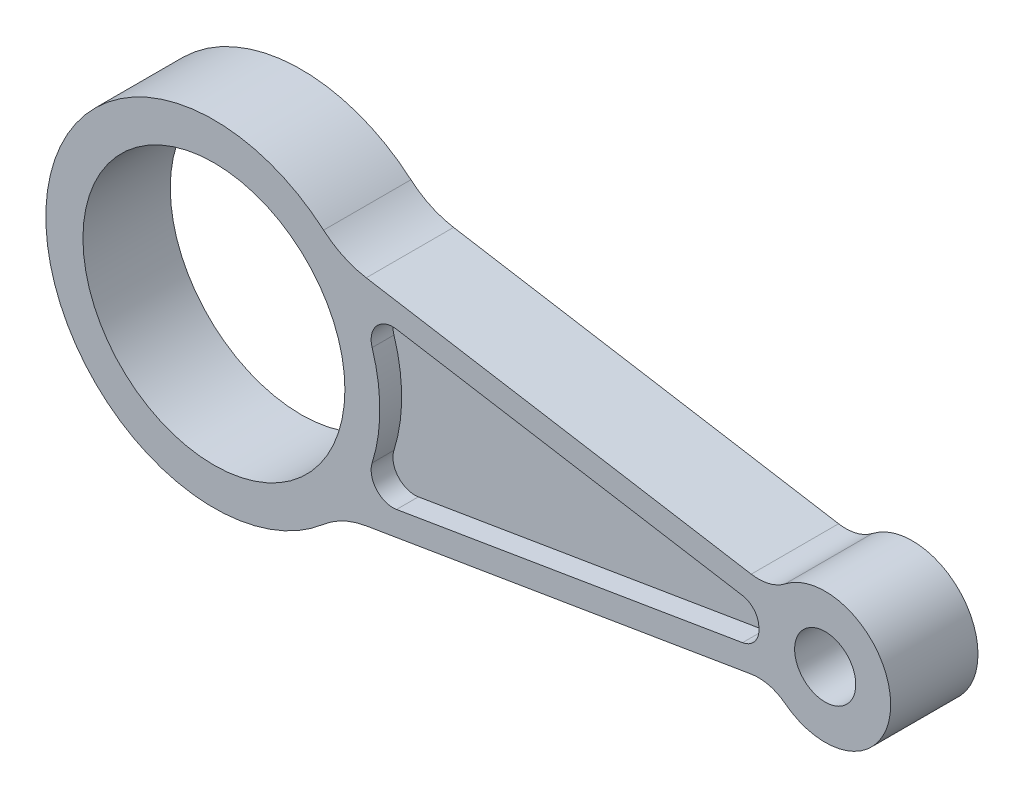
ISO-10303-21;
HEADER;
FILE_DESCRIPTION(('STEP AP214'),'2;1');
FILE_NAME('part.step','',(''),(''),'','','');
FILE_SCHEMA(('AUTOMOTIVE_DESIGN { 1 0 10303 214 1 1 1 1 }'));
ENDSEC;
DATA;
#1=APPLICATION_CONTEXT('core data for automotive mechanical design processes');
#2=APPLICATION_PROTOCOL_DEFINITION('international standard','automotive_design',2000,#1);
#3=PRODUCT_CONTEXT('',#1,'mechanical');
#4=PRODUCT('Part','Part','',(#3));
#5=PRODUCT_RELATED_PRODUCT_CATEGORY('part','',(#4));
#6=PRODUCT_DEFINITION_FORMATION('','',#4);
#7=PRODUCT_DEFINITION_CONTEXT('part definition',#1,'design');
#8=PRODUCT_DEFINITION('design','',#6,#7);
#9=PRODUCT_DEFINITION_SHAPE('','',#8);
#10=(LENGTH_UNIT() NAMED_UNIT(*) SI_UNIT(.MILLI.,.METRE.));
#11=(NAMED_UNIT(*) PLANE_ANGLE_UNIT() SI_UNIT($,.RADIAN.));
#12=(NAMED_UNIT(*) SI_UNIT($,.STERADIAN.) SOLID_ANGLE_UNIT());
#13=UNCERTAINTY_MEASURE_WITH_UNIT(LENGTH_MEASURE(1.E-05),#10,'distance_accuracy_value','');
#14=(GEOMETRIC_REPRESENTATION_CONTEXT(3) GLOBAL_UNCERTAINTY_ASSIGNED_CONTEXT((#13)) GLOBAL_UNIT_ASSIGNED_CONTEXT((#10,
#11,#12)) REPRESENTATION_CONTEXT('',''));
#15=CARTESIAN_POINT('',(0.,0.,0.));
#16=DIRECTION('',(0.,0.,1.));
#17=DIRECTION('',(1.,0.,0.));
#18=AXIS2_PLACEMENT_3D('',#15,#16,#17);
#19=CARTESIAN_POINT('',(0.,0.,-20.));
#20=DIRECTION('',(0.,0.,1.));
#21=DIRECTION('',(1.,0.,0.));
#22=AXIS2_PLACEMENT_3D('',#19,#20,#21);
#23=CYLINDRICAL_SURFACE('',#22,38.5);
#24=CARTESIAN_POINT('',(0.,0.,0.));
#25=DIRECTION('',(0.,0.,1.));
#26=DIRECTION('',(1.,0.,0.));
#27=AXIS2_PLACEMENT_3D('',#24,#25,#26);
#28=CIRCLE('',#27,38.5);
#29=CARTESIAN_POINT('',(25.1205794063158,29.1754432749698,0.));
#30=VERTEX_POINT('',#29);
#31=CARTESIAN_POINT('',(25.1205794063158,-29.1754432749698,0.));
#32=VERTEX_POINT('',#31);
#33=EDGE_CURVE('E309',#30,#32,#28,.T.);
#34=ORIENTED_EDGE('',*,*,#33,.F.);
#35=DIRECTION('',(0.,0.,1.));
#36=VECTOR('',#35,1.);
#37=CARTESIAN_POINT('',(25.1205794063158,29.1754432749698,-20.));
#38=LINE('',#37,#36);
#39=CARTESIAN_POINT('',(25.1205794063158,29.1754432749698,-20.));
#40=VERTEX_POINT('',#39);
#41=EDGE_CURVE('E358',#30,#40,#38,.F.);
#42=ORIENTED_EDGE('',*,*,#41,.T.);
#43=CARTESIAN_POINT('',(0.,0.,-20.));
#44=DIRECTION('',(0.,0.,1.));
#45=DIRECTION('',(1.,0.,0.));
#46=AXIS2_PLACEMENT_3D('',#43,#44,#45);
#47=CIRCLE('',#46,38.5);
#48=CARTESIAN_POINT('',(25.1205794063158,-29.1754432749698,-20.));
#49=VERTEX_POINT('',#48);
#50=EDGE_CURVE('E312',#40,#49,#47,.T.);
#51=ORIENTED_EDGE('',*,*,#50,.T.);
#52=DIRECTION('',(0.,0.,1.));
#53=VECTOR('',#52,1.);
#54=CARTESIAN_POINT('',(25.1205794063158,-29.1754432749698,-20.));
#55=LINE('',#54,#53);
#56=EDGE_CURVE('E355',#49,#32,#55,.T.);
#57=ORIENTED_EDGE('',*,*,#56,.T.);
#58=EDGE_LOOP('',(#34,#42,#51,#57));
#59=FACE_BOUND('',#58,.T.);
#60=ADVANCED_FACE('F35',(#59),#23,.T.);
#61=CARTESIAN_POINT('',(28.7305711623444,25.6281930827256,-20.));
#62=DIRECTION('',(0.164285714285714,0.986412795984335,0.));
#63=DIRECTION('',(-0.986412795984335,0.164285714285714,0.));
#64=AXIS2_PLACEMENT_3D('',#61,#62,#63);
#65=PLANE('',#64);
#66=DIRECTION('',(-0.986412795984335,0.164285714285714,0.));
#67=VECTOR('',#66,1.);
#68=CARTESIAN_POINT('',(28.7305711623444,25.6281930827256,-20.));
#69=LINE('',#68,#67);
#70=CARTESIAN_POINT('',(123.068754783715,9.91629645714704,-20.));
#71=VERTEX_POINT('',#70);
#72=CARTESIAN_POINT('',(34.8845167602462,24.6032617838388,-20.));
#73=VERTEX_POINT('',#72);
#74=EDGE_CURVE('E321',#71,#73,#69,.T.);
#75=ORIENTED_EDGE('',*,*,#74,.T.);
#76=DIRECTION('',(0.,0.,-1.));
#77=VECTOR('',#76,1.);
#78=CARTESIAN_POINT('',(34.8845167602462,24.6032617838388,0.));
#79=LINE('',#78,#77);
#80=CARTESIAN_POINT('',(34.8845167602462,24.6032617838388,0.));
#81=VERTEX_POINT('',#80);
#82=EDGE_CURVE('E352',#73,#81,#79,.F.);
#83=ORIENTED_EDGE('',*,*,#82,.T.);
#84=DIRECTION('',(-0.986412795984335,0.164285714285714,0.));
#85=VECTOR('',#84,1.);
#86=CARTESIAN_POINT('',(28.7305711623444,25.6281930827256,0.));
#87=LINE('',#86,#85);
#88=CARTESIAN_POINT('',(123.068754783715,9.91629645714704,0.));
#89=VERTEX_POINT('',#88);
#90=EDGE_CURVE('E316',#89,#81,#87,.T.);
#91=ORIENTED_EDGE('',*,*,#90,.F.);
#92=DIRECTION('',(0.,0.,-1.));
#93=VECTOR('',#92,1.);
#94=CARTESIAN_POINT('',(123.068754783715,9.91629645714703,-20.));
#95=LINE('',#94,#93);
#96=EDGE_CURVE('E338',#89,#71,#95,.T.);
#97=ORIENTED_EDGE('',*,*,#96,.T.);
#98=EDGE_LOOP('',(#75,#83,#91,#97));
#99=FACE_BOUND('',#98,.T.);
#100=ADVANCED_FACE('F390',(#99),#65,.T.);
#101=CARTESIAN_POINT('',(140.,0.,-20.));
#102=DIRECTION('',(0.,0.,1.));
#103=DIRECTION('',(1.,0.,0.));
#104=AXIS2_PLACEMENT_3D('',#101,#102,#103);
#105=CYLINDRICAL_SURFACE('',#104,15.);
#106=CARTESIAN_POINT('',(140.,0.,-20.));
#107=DIRECTION('',(0.,0.,1.));
#108=DIRECTION('',(1.,0.,0.));
#109=AXIS2_PLACEMENT_3D('',#106,#107,#108);
#110=CIRCLE('',#109,15.);
#111=CARTESIAN_POINT('',(130.826967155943,-11.8682546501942,-20.));
#112=VERTEX_POINT('',#111);
#113=CARTESIAN_POINT('',(130.826967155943,11.8682546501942,-20.));
#114=VERTEX_POINT('',#113);
#115=EDGE_CURVE('E318',#112,#114,#110,.T.);
#116=ORIENTED_EDGE('',*,*,#115,.T.);
#117=DIRECTION('',(0.,0.,1.));
#118=VECTOR('',#117,1.);
#119=CARTESIAN_POINT('',(130.826967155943,11.8682546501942,-20.));
#120=LINE('',#119,#118);
#121=CARTESIAN_POINT('',(130.826967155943,11.8682546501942,0.));
#122=VERTEX_POINT('',#121);
#123=EDGE_CURVE('E335',#114,#122,#120,.T.);
#124=ORIENTED_EDGE('',*,*,#123,.T.);
#125=CARTESIAN_POINT('',(140.,0.,0.));
#126=DIRECTION('',(0.,0.,1.));
#127=DIRECTION('',(1.,0.,0.));
#128=AXIS2_PLACEMENT_3D('',#125,#126,#127);
#129=CIRCLE('',#128,15.);
#130=CARTESIAN_POINT('',(130.826967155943,-11.8682546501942,0.));
#131=VERTEX_POINT('',#130);
#132=EDGE_CURVE('E329',#131,#122,#129,.T.);
#133=ORIENTED_EDGE('',*,*,#132,.F.);
#134=DIRECTION('',(0.,0.,1.));
#135=VECTOR('',#134,1.);
#136=CARTESIAN_POINT('',(130.826967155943,-11.8682546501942,-20.));
#137=LINE('',#136,#135);
#138=EDGE_CURVE('E324',#131,#112,#137,.F.);
#139=ORIENTED_EDGE('',*,*,#138,.T.);
#140=EDGE_LOOP('',(#116,#124,#133,#139));
#141=FACE_BOUND('',#140,.T.);
#142=ADVANCED_FACE('F399',(#141),#105,.T.);
#143=CARTESIAN_POINT('',(28.7305711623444,-25.6281930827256,-20.));
#144=DIRECTION('',(0.164285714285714,-0.986412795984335,0.));
#145=DIRECTION('',(0.986412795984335,0.164285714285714,0.));
#146=AXIS2_PLACEMENT_3D('',#143,#144,#145);
#147=PLANE('',#146);
#148=DIRECTION('',(0.986412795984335,0.164285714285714,0.));
#149=VECTOR('',#148,1.);
#150=CARTESIAN_POINT('',(28.7305711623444,-25.6281930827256,0.));
#151=LINE('',#150,#149);
#152=CARTESIAN_POINT('',(34.8845167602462,-24.6032617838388,0.));
#153=VERTEX_POINT('',#152);
#154=CARTESIAN_POINT('',(123.068754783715,-9.91629645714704,0.));
#155=VERTEX_POINT('',#154);
#156=EDGE_CURVE('E327',#153,#155,#151,.T.);
#157=ORIENTED_EDGE('',*,*,#156,.F.);
#158=DIRECTION('',(0.,0.,-1.));
#159=VECTOR('',#158,1.);
#160=CARTESIAN_POINT('',(34.8845167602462,-24.6032617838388,-20.));
#161=LINE('',#160,#159);
#162=CARTESIAN_POINT('',(34.8845167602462,-24.6032617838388,-20.));
#163=VERTEX_POINT('',#162);
#164=EDGE_CURVE('E360',#153,#163,#161,.T.);
#165=ORIENTED_EDGE('',*,*,#164,.T.);
#166=DIRECTION('',(0.986412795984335,0.164285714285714,0.));
#167=VECTOR('',#166,1.);
#168=CARTESIAN_POINT('',(28.7305711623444,-25.6281930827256,-20.));
#169=LINE('',#168,#167);
#170=CARTESIAN_POINT('',(123.068754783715,-9.91629645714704,-20.));
#171=VERTEX_POINT('',#170);
#172=EDGE_CURVE('E315',#163,#171,#169,.T.);
#173=ORIENTED_EDGE('',*,*,#172,.T.);
#174=DIRECTION('',(0.,0.,-1.));
#175=VECTOR('',#174,1.);
#176=CARTESIAN_POINT('',(123.068754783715,-9.91629645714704,0.));
#177=LINE('',#176,#175);
#178=EDGE_CURVE('E340',#171,#155,#177,.F.);
#179=ORIENTED_EDGE('',*,*,#178,.T.);
#180=EDGE_LOOP('',(#157,#165,#173,#179));
#181=FACE_BOUND('',#180,.T.);
#182=ADVANCED_FACE('F374',(#181),#147,.T.);
#183=CARTESIAN_POINT('',(0.,0.,-20.));
#184=DIRECTION('',(0.,0.,1.));
#185=DIRECTION('',(1.,0.,0.));
#186=AXIS2_PLACEMENT_3D('',#183,#184,#185);
#187=PLANE('',#186);
#188=DIRECTION('',(0.986412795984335,-0.164285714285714,0.));
#189=VECTOR('',#188,1.);
#190=CARTESIAN_POINT('',(121.445609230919,4.61087017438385,-20.));
#191=LINE('',#190,#189);
#192=CARTESIAN_POINT('',(41.8285545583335,17.8709827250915,-20.));
#193=VERTEX_POINT('',#192);
#194=CARTESIAN_POINT('',(121.445609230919,4.61087017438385,-20.));
#195=VERTEX_POINT('',#194);
#196=EDGE_CURVE('E221',#193,#195,#191,.T.);
#197=ORIENTED_EDGE('',*,*,#196,.F.);
#198=CARTESIAN_POINT('',(41.0071259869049,12.9389187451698,-20.));
#199=DIRECTION('',(0.,0.,-1.));
#200=DIRECTION('',(1.,0.,0.));
#201=AXIS2_PLACEMENT_3D('',#198,#199,#200);
#202=CIRCLE('',#201,5.);
#203=CARTESIAN_POINT('',(36.2388555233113,11.4343933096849,-20.));
#204=VERTEX_POINT('',#203);
#205=EDGE_CURVE('E50',#204,#193,#202,.T.);
#206=ORIENTED_EDGE('',*,*,#205,.F.);
#207=CARTESIAN_POINT('',(0.,0.,-20.));
#208=DIRECTION('',(0.,0.,1.));
#209=DIRECTION('',(-1.,0.,0.));
#210=AXIS2_PLACEMENT_3D('',#207,#208,#209);
#211=CIRCLE('',#210,38.);
#212=CARTESIAN_POINT('',(36.2388555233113,-11.4343933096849,-20.));
#213=VERTEX_POINT('',#212);
#214=EDGE_CURVE('E204',#213,#204,#211,.T.);
#215=ORIENTED_EDGE('',*,*,#214,.F.);
#216=CARTESIAN_POINT('',(41.0071259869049,-12.9389187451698,-20.));
#217=DIRECTION('',(0.,0.,-1.));
#218=DIRECTION('',(-1.,0.,0.));
#219=AXIS2_PLACEMENT_3D('',#216,#217,#218);
#220=CIRCLE('',#219,5.);
#221=CARTESIAN_POINT('',(41.8285545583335,-17.8709827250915,-20.));
#222=VERTEX_POINT('',#221);
#223=EDGE_CURVE('E207',#222,#213,#220,.T.);
#224=ORIENTED_EDGE('',*,*,#223,.F.);
#225=DIRECTION('',(-0.986412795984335,-0.164285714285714,0.));
#226=VECTOR('',#225,1.);
#227=CARTESIAN_POINT('',(121.433526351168,-4.61288256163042,-20.));
#228=LINE('',#227,#226);
#229=CARTESIAN_POINT('',(121.433526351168,-4.61288256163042,-20.));
#230=VERTEX_POINT('',#229);
#231=EDGE_CURVE('E229',#230,#222,#228,.T.);
#232=ORIENTED_EDGE('',*,*,#231,.F.);
#233=CARTESIAN_POINT('',(120.694240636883,-0.174024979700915,-20.));
#234=DIRECTION('',(0.,0.,-1.));
#235=DIRECTION('',(-1.,0.,0.));
#236=AXIS2_PLACEMENT_3D('',#233,#234,#235);
#237=CIRCLE('',#236,4.5);
#238=CARTESIAN_POINT('',(125.194211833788,-0.157924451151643,-20.));
#239=VERTEX_POINT('',#238);
#240=EDGE_CURVE('E226',#239,#230,#237,.T.);
#241=ORIENTED_EDGE('',*,*,#240,.F.);
#242=CARTESIAN_POINT('',(120.706323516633,0.172012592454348,-20.));
#243=DIRECTION('',(0.,0.,-1.));
#244=DIRECTION('',(1.,0.,0.));
#245=AXIS2_PLACEMENT_3D('',#242,#243,#244);
#246=CIRCLE('',#245,4.5);
#247=EDGE_CURVE('E223',#195,#239,#246,.T.);
#248=ORIENTED_EDGE('',*,*,#247,.F.);
#249=EDGE_LOOP('',(#197,#206,#215,#224,#232,#241,#248));
#250=FACE_BOUND('',#249,.T.);
#251=CARTESIAN_POINT('',(140.,0.,-20.));
#252=DIRECTION('',(0.,0.,1.));
#253=DIRECTION('',(1.,0.,0.));
#254=AXIS2_PLACEMENT_3D('',#251,#252,#253);
#255=CIRCLE('',#254,7.00000000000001);
#256=CARTESIAN_POINT('',(147.,0.,-20.));
#257=VERTEX_POINT('',#256);
#258=EDGE_CURVE('E300',#257,#257,#255,.T.);
#259=ORIENTED_EDGE('',*,*,#258,.T.);
#260=EDGE_LOOP('',(#259));
#261=FACE_BOUND('',#260,.T.);
#262=CARTESIAN_POINT('',(0.,0.,-20.));
#263=DIRECTION('',(0.,0.,1.));
#264=DIRECTION('',(1.,0.,0.));
#265=AXIS2_PLACEMENT_3D('',#262,#263,#264);
#266=CIRCLE('',#265,30.);
#267=CARTESIAN_POINT('',(30.,0.,-20.));
#268=VERTEX_POINT('',#267);
#269=EDGE_CURVE('E306',#268,#268,#266,.T.);
#270=ORIENTED_EDGE('',*,*,#269,.T.);
#271=EDGE_LOOP('',(#270));
#272=FACE_BOUND('',#271,.T.);
#273=ORIENTED_EDGE('',*,*,#50,.F.);
#274=CARTESIAN_POINT('',(38.1702310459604,44.3315177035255,-20.));
#275=DIRECTION('',(0.,0.,1.));
#276=DIRECTION('',(1.,0.,0.));
#277=AXIS2_PLACEMENT_3D('',#274,#275,#276);
#278=CIRCLE('',#277,20.);
#279=EDGE_CURVE('E364',#40,#73,#278,.T.);
#280=ORIENTED_EDGE('',*,*,#279,.T.);
#281=ORIENTED_EDGE('',*,*,#74,.F.);
#282=CARTESIAN_POINT('',(124.711611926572,19.7804244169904,-20.));
#283=DIRECTION('',(0.,0.,1.));
#284=DIRECTION('',(1.,0.,0.));
#285=AXIS2_PLACEMENT_3D('',#282,#283,#284);
#286=CIRCLE('',#285,10.);
#287=EDGE_CURVE('E345',#71,#114,#286,.T.);
#288=ORIENTED_EDGE('',*,*,#287,.T.);
#289=ORIENTED_EDGE('',*,*,#115,.F.);
#290=CARTESIAN_POINT('',(124.711611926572,-19.7804244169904,-20.));
#291=DIRECTION('',(0.,0.,1.));
#292=DIRECTION('',(1.,0.,0.));
#293=AXIS2_PLACEMENT_3D('',#290,#291,#292);
#294=CIRCLE('',#293,10.);
#295=EDGE_CURVE('E349',#112,#171,#294,.T.);
#296=ORIENTED_EDGE('',*,*,#295,.T.);
#297=ORIENTED_EDGE('',*,*,#172,.F.);
#298=CARTESIAN_POINT('',(38.1702310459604,-44.3315177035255,-20.));
#299=DIRECTION('',(0.,0.,1.));
#300=DIRECTION('',(1.,0.,0.));
#301=AXIS2_PLACEMENT_3D('',#298,#299,#300);
#302=CIRCLE('',#301,20.);
#303=EDGE_CURVE('E11',#163,#49,#302,.T.);
#304=ORIENTED_EDGE('',*,*,#303,.T.);
#305=EDGE_LOOP('',(#273,#280,#281,#288,#289,#296,#297,#304));
#306=FACE_BOUND('',#305,.T.);
#307=ADVANCED_FACE('F380',(#250,#261,#272,#306),#187,.F.);
#308=CARTESIAN_POINT('',(0.,0.,0.));
#309=DIRECTION('',(0.,0.,1.));
#310=DIRECTION('',(1.,0.,0.));
#311=AXIS2_PLACEMENT_3D('',#308,#309,#310);
#312=PLANE('',#311);
#313=CARTESIAN_POINT('',(41.0071259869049,12.9389187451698,0.));
#314=DIRECTION('',(0.,0.,1.));
#315=DIRECTION('',(-1.,0.,0.));
#316=AXIS2_PLACEMENT_3D('',#313,#314,#315);
#317=CIRCLE('',#316,5.);
#318=CARTESIAN_POINT('',(41.8285545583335,17.8709827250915,0.));
#319=VERTEX_POINT('',#318);
#320=CARTESIAN_POINT('',(36.2388555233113,11.4343933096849,0.));
#321=VERTEX_POINT('',#320);
#322=EDGE_CURVE('E58',#319,#321,#317,.T.);
#323=ORIENTED_EDGE('',*,*,#322,.F.);
#324=DIRECTION('',(-0.986412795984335,0.164285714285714,0.));
#325=VECTOR('',#324,1.);
#326=CARTESIAN_POINT('',(41.8285545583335,17.8709827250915,0.));
#327=LINE('',#326,#325);
#328=CARTESIAN_POINT('',(121.046940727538,4.67726787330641,0.));
#329=VERTEX_POINT('',#328);
#330=EDGE_CURVE('E249',#329,#319,#327,.T.);
#331=ORIENTED_EDGE('',*,*,#330,.F.);
#332=CARTESIAN_POINT('',(120.307655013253,0.238410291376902,0.));
#333=DIRECTION('',(0.,0.,1.));
#334=DIRECTION('',(1.,0.,0.));
#335=AXIS2_PLACEMENT_3D('',#332,#333,#334);
#336=CIRCLE('',#335,4.5);
#337=CARTESIAN_POINT('',(124.807655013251,0.238406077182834,0.));
#338=VERTEX_POINT('',#337);
#339=EDGE_CURVE('E281',#338,#329,#336,.T.);
#340=ORIENTED_EDGE('',*,*,#339,.F.);
#341=CARTESIAN_POINT('',(120.332548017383,-0.234264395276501,0.));
#342=DIRECTION('',(0.,0.,1.));
#343=DIRECTION('',(-1.,0.,0.));
#344=AXIS2_PLACEMENT_3D('',#341,#342,#343);
#345=CIRCLE('',#344,4.5);
#346=CARTESIAN_POINT('',(121.071833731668,-4.67312197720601,0.));
#347=VERTEX_POINT('',#346);
#348=EDGE_CURVE('E278',#347,#338,#345,.T.);
#349=ORIENTED_EDGE('',*,*,#348,.F.);
#350=DIRECTION('',(0.986412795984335,0.164285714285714,0.));
#351=VECTOR('',#350,1.);
#352=CARTESIAN_POINT('',(41.8285545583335,-17.8709827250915,0.));
#353=LINE('',#352,#351);
#354=CARTESIAN_POINT('',(41.8285545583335,-17.8709827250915,0.));
#355=VERTEX_POINT('',#354);
#356=EDGE_CURVE('E275',#355,#347,#353,.T.);
#357=ORIENTED_EDGE('',*,*,#356,.F.);
#358=CARTESIAN_POINT('',(41.0071259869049,-12.9389187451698,0.));
#359=DIRECTION('',(0.,0.,1.));
#360=DIRECTION('',(-1.,0.,0.));
#361=AXIS2_PLACEMENT_3D('',#358,#359,#360);
#362=CIRCLE('',#361,5.);
#363=CARTESIAN_POINT('',(36.2388555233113,-11.4343933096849,0.));
#364=VERTEX_POINT('',#363);
#365=EDGE_CURVE('E272',#364,#355,#362,.T.);
#366=ORIENTED_EDGE('',*,*,#365,.F.);
#367=CARTESIAN_POINT('',(0.,0.,0.));
#368=DIRECTION('',(0.,0.,-1.));
#369=DIRECTION('',(1.,0.,0.));
#370=AXIS2_PLACEMENT_3D('',#367,#368,#369);
#371=CIRCLE('',#370,38.);
#372=EDGE_CURVE('E269',#321,#364,#371,.T.);
#373=ORIENTED_EDGE('',*,*,#372,.F.);
#374=EDGE_LOOP('',(#323,#331,#340,#349,#357,#366,#373));
#375=FACE_BOUND('',#374,.T.);
#376=CARTESIAN_POINT('',(140.,0.,0.));
#377=DIRECTION('',(0.,0.,1.));
#378=DIRECTION('',(1.,0.,0.));
#379=AXIS2_PLACEMENT_3D('',#376,#377,#378);
#380=CIRCLE('',#379,7.00000000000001);
#381=CARTESIAN_POINT('',(147.,0.,0.));
#382=VERTEX_POINT('',#381);
#383=EDGE_CURVE('E288',#382,#382,#380,.T.);
#384=ORIENTED_EDGE('',*,*,#383,.F.);
#385=EDGE_LOOP('',(#384));
#386=FACE_BOUND('',#385,.T.);
#387=CARTESIAN_POINT('',(0.,0.,0.));
#388=DIRECTION('',(0.,0.,1.));
#389=DIRECTION('',(1.,0.,0.));
#390=AXIS2_PLACEMENT_3D('',#387,#388,#389);
#391=CIRCLE('',#390,30.);
#392=CARTESIAN_POINT('',(30.,0.,0.));
#393=VERTEX_POINT('',#392);
#394=EDGE_CURVE('E303',#393,#393,#391,.T.);
#395=ORIENTED_EDGE('',*,*,#394,.F.);
#396=EDGE_LOOP('',(#395));
#397=FACE_BOUND('',#396,.T.);
#398=ORIENTED_EDGE('',*,*,#90,.T.);
#399=CARTESIAN_POINT('',(38.1702310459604,44.3315177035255,0.));
#400=DIRECTION('',(0.,0.,1.));
#401=DIRECTION('',(1.,0.,0.));
#402=AXIS2_PLACEMENT_3D('',#399,#400,#401);
#403=CIRCLE('',#402,20.);
#404=EDGE_CURVE('E362',#81,#30,#403,.F.);
#405=ORIENTED_EDGE('',*,*,#404,.T.);
#406=ORIENTED_EDGE('',*,*,#33,.T.);
#407=CARTESIAN_POINT('',(38.1702310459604,-44.3315177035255,0.));
#408=DIRECTION('',(0.,0.,1.));
#409=DIRECTION('',(1.,0.,0.));
#410=AXIS2_PLACEMENT_3D('',#407,#408,#409);
#411=CIRCLE('',#410,20.);
#412=EDGE_CURVE('E43',#32,#153,#411,.F.);
#413=ORIENTED_EDGE('',*,*,#412,.T.);
#414=ORIENTED_EDGE('',*,*,#156,.T.);
#415=CARTESIAN_POINT('',(124.711611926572,-19.7804244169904,0.));
#416=DIRECTION('',(0.,0.,1.));
#417=DIRECTION('',(1.,0.,0.));
#418=AXIS2_PLACEMENT_3D('',#415,#416,#417);
#419=CIRCLE('',#418,10.);
#420=EDGE_CURVE('E347',#155,#131,#419,.F.);
#421=ORIENTED_EDGE('',*,*,#420,.T.);
#422=ORIENTED_EDGE('',*,*,#132,.T.);
#423=CARTESIAN_POINT('',(124.711611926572,19.7804244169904,0.));
#424=DIRECTION('',(0.,0.,1.));
#425=DIRECTION('',(1.,0.,0.));
#426=AXIS2_PLACEMENT_3D('',#423,#424,#425);
#427=CIRCLE('',#426,10.);
#428=EDGE_CURVE('E343',#122,#89,#427,.F.);
#429=ORIENTED_EDGE('',*,*,#428,.T.);
#430=EDGE_LOOP('',(#398,#405,#406,#413,#414,#421,#422,#429));
#431=FACE_BOUND('',#430,.T.);
#432=ADVANCED_FACE('F367',(#375,#386,#397,#431),#312,.T.);
#433=CARTESIAN_POINT('',(0.,0.,-20.));
#434=DIRECTION('',(0.,0.,1.));
#435=DIRECTION('',(1.,0.,0.));
#436=AXIS2_PLACEMENT_3D('',#433,#434,#435);
#437=CYLINDRICAL_SURFACE('',#436,30.);
#438=ORIENTED_EDGE('',*,*,#269,.F.);
#439=EDGE_LOOP('',(#438));
#440=FACE_BOUND('',#439,.T.);
#441=ORIENTED_EDGE('',*,*,#394,.T.);
#442=EDGE_LOOP('',(#441));
#443=FACE_BOUND('',#442,.T.);
#444=ADVANCED_FACE('F425',(#440,#443),#437,.F.);
#445=CARTESIAN_POINT('',(140.,0.,-20.));
#446=DIRECTION('',(0.,0.,1.));
#447=DIRECTION('',(1.,0.,0.));
#448=AXIS2_PLACEMENT_3D('',#445,#446,#447);
#449=CYLINDRICAL_SURFACE('',#448,7.00000000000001);
#450=ORIENTED_EDGE('',*,*,#258,.F.);
#451=EDGE_LOOP('',(#450));
#452=FACE_BOUND('',#451,.T.);
#453=ORIENTED_EDGE('',*,*,#383,.T.);
#454=EDGE_LOOP('',(#453));
#455=FACE_BOUND('',#454,.T.);
#456=ADVANCED_FACE('F410',(#452,#455),#449,.F.);
#457=CARTESIAN_POINT('',(124.711611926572,19.7804244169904,-20.));
#458=DIRECTION('',(0.,0.,1.));
#459=DIRECTION('',(1.,0.,0.));
#460=AXIS2_PLACEMENT_3D('',#457,#458,#459);
#461=CYLINDRICAL_SURFACE('',#460,10.);
#462=ORIENTED_EDGE('',*,*,#287,.F.);
#463=ORIENTED_EDGE('',*,*,#96,.F.);
#464=ORIENTED_EDGE('',*,*,#428,.F.);
#465=ORIENTED_EDGE('',*,*,#123,.F.);
#466=EDGE_LOOP('',(#462,#463,#464,#465));
#467=FACE_BOUND('',#466,.T.);
#468=ADVANCED_FACE('F394',(#467),#461,.F.);
#469=CARTESIAN_POINT('',(124.711611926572,-19.7804244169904,-20.));
#470=DIRECTION('',(0.,0.,1.));
#471=DIRECTION('',(1.,0.,0.));
#472=AXIS2_PLACEMENT_3D('',#469,#470,#471);
#473=CYLINDRICAL_SURFACE('',#472,10.);
#474=ORIENTED_EDGE('',*,*,#295,.F.);
#475=ORIENTED_EDGE('',*,*,#138,.F.);
#476=ORIENTED_EDGE('',*,*,#420,.F.);
#477=ORIENTED_EDGE('',*,*,#178,.F.);
#478=EDGE_LOOP('',(#474,#475,#476,#477));
#479=FACE_BOUND('',#478,.T.);
#480=ADVANCED_FACE('F403',(#479),#473,.F.);
#481=CARTESIAN_POINT('',(38.1702310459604,44.3315177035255,-20.));
#482=DIRECTION('',(0.,0.,1.));
#483=DIRECTION('',(1.,0.,0.));
#484=AXIS2_PLACEMENT_3D('',#481,#482,#483);
#485=CYLINDRICAL_SURFACE('',#484,20.);
#486=ORIENTED_EDGE('',*,*,#279,.F.);
#487=ORIENTED_EDGE('',*,*,#41,.F.);
#488=ORIENTED_EDGE('',*,*,#404,.F.);
#489=ORIENTED_EDGE('',*,*,#82,.F.);
#490=EDGE_LOOP('',(#486,#487,#488,#489));
#491=FACE_BOUND('',#490,.T.);
#492=ADVANCED_FACE('F385',(#491),#485,.F.);
#493=CARTESIAN_POINT('',(38.1702310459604,-44.3315177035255,-20.));
#494=DIRECTION('',(0.,0.,1.));
#495=DIRECTION('',(1.,0.,0.));
#496=AXIS2_PLACEMENT_3D('',#493,#494,#495);
#497=CYLINDRICAL_SURFACE('',#496,20.);
#498=ORIENTED_EDGE('',*,*,#303,.F.);
#499=ORIENTED_EDGE('',*,*,#164,.F.);
#500=ORIENTED_EDGE('',*,*,#412,.F.);
#501=ORIENTED_EDGE('',*,*,#56,.F.);
#502=EDGE_LOOP('',(#498,#499,#500,#501));
#503=FACE_BOUND('',#502,.T.);
#504=ADVANCED_FACE('F37',(#503),#497,.F.);
#505=CARTESIAN_POINT('',(41.0071259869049,12.9389187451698,-5.));
#506=DIRECTION('',(0.,0.,1.));
#507=DIRECTION('',(1.,0.,0.));
#508=AXIS2_PLACEMENT_3D('',#505,#506,#507);
#509=CYLINDRICAL_SURFACE('',#508,5.);
#510=ORIENTED_EDGE('',*,*,#322,.T.);
#511=DIRECTION('',(0.,0.,1.));
#512=VECTOR('',#511,1.);
#513=CARTESIAN_POINT('',(36.2388555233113,11.4343933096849,-5.));
#514=LINE('',#513,#512);
#515=CARTESIAN_POINT('',(36.2388555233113,11.4343933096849,-5.));
#516=VERTEX_POINT('',#515);
#517=EDGE_CURVE('E267',#516,#321,#514,.T.);
#518=ORIENTED_EDGE('',*,*,#517,.F.);
#519=CARTESIAN_POINT('',(41.0071259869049,12.9389187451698,-5.));
#520=DIRECTION('',(0.,0.,1.));
#521=DIRECTION('',(-1.,0.,0.));
#522=AXIS2_PLACEMENT_3D('',#519,#520,#521);
#523=CIRCLE('',#522,5.);
#524=CARTESIAN_POINT('',(41.8285545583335,17.8709827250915,-5.));
#525=VERTEX_POINT('',#524);
#526=EDGE_CURVE('E245',#525,#516,#523,.T.);
#527=ORIENTED_EDGE('',*,*,#526,.F.);
#528=DIRECTION('',(0.,0.,1.));
#529=VECTOR('',#528,1.);
#530=CARTESIAN_POINT('',(41.8285545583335,17.8709827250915,-5.));
#531=LINE('',#530,#529);
#532=EDGE_CURVE('E286',#525,#319,#531,.T.);
#533=ORIENTED_EDGE('',*,*,#532,.T.);
#534=EDGE_LOOP('',(#510,#518,#527,#533));
#535=FACE_BOUND('',#534,.T.);
#536=ADVANCED_FACE('F436',(#535),#509,.F.);
#537=CARTESIAN_POINT('',(41.8285545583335,17.8709827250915,-5.));
#538=DIRECTION('',(0.164285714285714,0.986412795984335,0.));
#539=DIRECTION('',(-0.986412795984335,0.164285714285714,0.));
#540=AXIS2_PLACEMENT_3D('',#537,#538,#539);
#541=PLANE('',#540);
#542=ORIENTED_EDGE('',*,*,#330,.T.);
#543=ORIENTED_EDGE('',*,*,#532,.F.);
#544=DIRECTION('',(-0.986412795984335,0.164285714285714,0.));
#545=VECTOR('',#544,1.);
#546=CARTESIAN_POINT('',(41.8285545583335,17.8709827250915,-5.));
#547=LINE('',#546,#545);
#548=CARTESIAN_POINT('',(121.046940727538,4.67726787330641,-5.));
#549=VERTEX_POINT('',#548);
#550=EDGE_CURVE('E264',#549,#525,#547,.T.);
#551=ORIENTED_EDGE('',*,*,#550,.F.);
#552=DIRECTION('',(0.,0.,1.));
#553=VECTOR('',#552,1.);
#554=CARTESIAN_POINT('',(121.046940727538,4.67726787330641,-5.));
#555=LINE('',#554,#553);
#556=EDGE_CURVE('E289',#549,#329,#555,.T.);
#557=ORIENTED_EDGE('',*,*,#556,.T.);
#558=EDGE_LOOP('',(#542,#543,#551,#557));
#559=FACE_BOUND('',#558,.T.);
#560=ADVANCED_FACE('F439',(#559),#541,.F.);
#561=CARTESIAN_POINT('',(120.307655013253,0.238410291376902,-5.));
#562=DIRECTION('',(0.,0.,1.));
#563=DIRECTION('',(1.,0.,0.));
#564=AXIS2_PLACEMENT_3D('',#561,#562,#563);
#565=CYLINDRICAL_SURFACE('',#564,4.5);
#566=ORIENTED_EDGE('',*,*,#339,.T.);
#567=ORIENTED_EDGE('',*,*,#556,.F.);
#568=CARTESIAN_POINT('',(120.307655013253,0.238410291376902,-5.));
#569=DIRECTION('',(0.,0.,1.));
#570=DIRECTION('',(1.,0.,0.));
#571=AXIS2_PLACEMENT_3D('',#568,#569,#570);
#572=CIRCLE('',#571,4.5);
#573=CARTESIAN_POINT('',(124.807655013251,0.238406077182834,-5.));
#574=VERTEX_POINT('',#573);
#575=EDGE_CURVE('E261',#574,#549,#572,.T.);
#576=ORIENTED_EDGE('',*,*,#575,.F.);
#577=DIRECTION('',(0.,0.,1.));
#578=VECTOR('',#577,1.);
#579=CARTESIAN_POINT('',(124.807655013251,0.238406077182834,-5.));
#580=LINE('',#579,#578);
#581=EDGE_CURVE('E291',#574,#338,#580,.T.);
#582=ORIENTED_EDGE('',*,*,#581,.T.);
#583=EDGE_LOOP('',(#566,#567,#576,#582));
#584=FACE_BOUND('',#583,.T.);
#585=ADVANCED_FACE('F456',(#584),#565,.F.);
#586=CARTESIAN_POINT('',(120.332548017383,-0.234264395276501,-5.));
#587=DIRECTION('',(0.,0.,1.));
#588=DIRECTION('',(1.,0.,0.));
#589=AXIS2_PLACEMENT_3D('',#586,#587,#588);
#590=CYLINDRICAL_SURFACE('',#589,4.5);
#591=ORIENTED_EDGE('',*,*,#348,.T.);
#592=ORIENTED_EDGE('',*,*,#581,.F.);
#593=CARTESIAN_POINT('',(120.332548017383,-0.234264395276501,-5.));
#594=DIRECTION('',(0.,0.,1.));
#595=DIRECTION('',(-1.,0.,0.));
#596=AXIS2_PLACEMENT_3D('',#593,#594,#595);
#597=CIRCLE('',#596,4.5);
#598=CARTESIAN_POINT('',(121.071833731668,-4.67312197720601,-5.));
#599=VERTEX_POINT('',#598);
#600=EDGE_CURVE('E258',#599,#574,#597,.T.);
#601=ORIENTED_EDGE('',*,*,#600,.F.);
#602=DIRECTION('',(0.,0.,1.));
#603=VECTOR('',#602,1.);
#604=CARTESIAN_POINT('',(121.071833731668,-4.67312197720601,-5.));
#605=LINE('',#604,#603);
#606=EDGE_CURVE('E293',#599,#347,#605,.T.);
#607=ORIENTED_EDGE('',*,*,#606,.T.);
#608=EDGE_LOOP('',(#591,#592,#601,#607));
#609=FACE_BOUND('',#608,.T.);
#610=ADVANCED_FACE('F452',(#609),#590,.F.);
#611=CARTESIAN_POINT('',(41.8285545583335,-17.8709827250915,-5.));
#612=DIRECTION('',(0.164285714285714,-0.986412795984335,0.));
#613=DIRECTION('',(0.986412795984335,0.164285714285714,0.));
#614=AXIS2_PLACEMENT_3D('',#611,#612,#613);
#615=PLANE('',#614);
#616=ORIENTED_EDGE('',*,*,#356,.T.);
#617=ORIENTED_EDGE('',*,*,#606,.F.);
#618=DIRECTION('',(0.986412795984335,0.164285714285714,0.));
#619=VECTOR('',#618,1.);
#620=CARTESIAN_POINT('',(41.8285545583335,-17.8709827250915,-5.));
#621=LINE('',#620,#619);
#622=CARTESIAN_POINT('',(41.8285545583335,-17.8709827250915,-5.));
#623=VERTEX_POINT('',#622);
#624=EDGE_CURVE('E255',#623,#599,#621,.T.);
#625=ORIENTED_EDGE('',*,*,#624,.F.);
#626=DIRECTION('',(0.,0.,1.));
#627=VECTOR('',#626,1.);
#628=CARTESIAN_POINT('',(41.8285545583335,-17.8709827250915,-5.));
#629=LINE('',#628,#627);
#630=EDGE_CURVE('E295',#623,#355,#629,.T.);
#631=ORIENTED_EDGE('',*,*,#630,.T.);
#632=EDGE_LOOP('',(#616,#617,#625,#631));
#633=FACE_BOUND('',#632,.T.);
#634=ADVANCED_FACE('F448',(#633),#615,.F.);
#635=CARTESIAN_POINT('',(41.0071259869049,-12.9389187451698,-5.));
#636=DIRECTION('',(0.,0.,1.));
#637=DIRECTION('',(1.,0.,0.));
#638=AXIS2_PLACEMENT_3D('',#635,#636,#637);
#639=CYLINDRICAL_SURFACE('',#638,5.);
#640=ORIENTED_EDGE('',*,*,#365,.T.);
#641=ORIENTED_EDGE('',*,*,#630,.F.);
#642=CARTESIAN_POINT('',(41.0071259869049,-12.9389187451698,-5.));
#643=DIRECTION('',(0.,0.,1.));
#644=DIRECTION('',(-1.,0.,0.));
#645=AXIS2_PLACEMENT_3D('',#642,#643,#644);
#646=CIRCLE('',#645,5.);
#647=CARTESIAN_POINT('',(36.2388555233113,-11.4343933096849,-5.));
#648=VERTEX_POINT('',#647);
#649=EDGE_CURVE('E252',#648,#623,#646,.T.);
#650=ORIENTED_EDGE('',*,*,#649,.F.);
#651=DIRECTION('',(0.,0.,1.));
#652=VECTOR('',#651,1.);
#653=CARTESIAN_POINT('',(36.2388555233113,-11.4343933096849,-5.));
#654=LINE('',#653,#652);
#655=EDGE_CURVE('E297',#648,#364,#654,.T.);
#656=ORIENTED_EDGE('',*,*,#655,.T.);
#657=EDGE_LOOP('',(#640,#641,#650,#656));
#658=FACE_BOUND('',#657,.T.);
#659=ADVANCED_FACE('F444',(#658),#639,.F.);
#660=CARTESIAN_POINT('',(0.,0.,-5.));
#661=DIRECTION('',(0.,0.,1.));
#662=DIRECTION('',(1.,0.,0.));
#663=AXIS2_PLACEMENT_3D('',#660,#661,#662);
#664=CYLINDRICAL_SURFACE('',#663,38.);
#665=ORIENTED_EDGE('',*,*,#372,.T.);
#666=ORIENTED_EDGE('',*,*,#655,.F.);
#667=CARTESIAN_POINT('',(0.,0.,-5.));
#668=DIRECTION('',(0.,0.,-1.));
#669=DIRECTION('',(1.,0.,0.));
#670=AXIS2_PLACEMENT_3D('',#667,#668,#669);
#671=CIRCLE('',#670,38.);
#672=EDGE_CURVE('E248',#516,#648,#671,.T.);
#673=ORIENTED_EDGE('',*,*,#672,.F.);
#674=ORIENTED_EDGE('',*,*,#517,.T.);
#675=EDGE_LOOP('',(#665,#666,#673,#674));
#676=FACE_BOUND('',#675,.T.);
#677=ADVANCED_FACE('F440',(#676),#664,.T.);
#678=CARTESIAN_POINT('',(41.0071259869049,12.9389187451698,-5.));
#679=DIRECTION('',(0.,0.,-1.));
#680=DIRECTION('',(-1.,0.,0.));
#681=AXIS2_PLACEMENT_3D('',#678,#679,#680);
#682=PLANE('',#681);
#683=ORIENTED_EDGE('',*,*,#526,.T.);
#684=ORIENTED_EDGE('',*,*,#672,.T.);
#685=ORIENTED_EDGE('',*,*,#649,.T.);
#686=ORIENTED_EDGE('',*,*,#624,.T.);
#687=ORIENTED_EDGE('',*,*,#600,.T.);
#688=ORIENTED_EDGE('',*,*,#575,.T.);
#689=ORIENTED_EDGE('',*,*,#550,.T.);
#690=EDGE_LOOP('',(#683,#684,#685,#686,#687,#688,#689));
#691=FACE_BOUND('',#690,.T.);
#692=ADVANCED_FACE('F443',(#691),#682,.F.);
#693=CARTESIAN_POINT('',(41.0071259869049,12.9389187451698,-15.));
#694=DIRECTION('',(0.,0.,-1.));
#695=DIRECTION('',(-1.,0.,0.));
#696=AXIS2_PLACEMENT_3D('',#693,#694,#695);
#697=CYLINDRICAL_SURFACE('',#696,5.);
#698=ORIENTED_EDGE('',*,*,#205,.T.);
#699=DIRECTION('',(0.,0.,-1.));
#700=VECTOR('',#699,1.);
#701=CARTESIAN_POINT('',(41.8285545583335,17.8709827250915,-15.));
#702=LINE('',#701,#700);
#703=CARTESIAN_POINT('',(41.8285545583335,17.8709827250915,-15.));
#704=VERTEX_POINT('',#703);
#705=EDGE_CURVE('E181',#704,#193,#702,.T.);
#706=ORIENTED_EDGE('',*,*,#705,.F.);
#707=CARTESIAN_POINT('',(41.0071259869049,12.9389187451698,-15.));
#708=DIRECTION('',(0.,0.,-1.));
#709=DIRECTION('',(1.,0.,0.));
#710=AXIS2_PLACEMENT_3D('',#707,#708,#709);
#711=CIRCLE('',#710,5.);
#712=CARTESIAN_POINT('',(36.2388555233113,11.4343933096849,-15.));
#713=VERTEX_POINT('',#712);
#714=EDGE_CURVE('E185',#713,#704,#711,.T.);
#715=ORIENTED_EDGE('',*,*,#714,.F.);
#716=DIRECTION('',(0.,0.,-1.));
#717=VECTOR('',#716,1.);
#718=CARTESIAN_POINT('',(36.2388555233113,11.4343933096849,-15.));
#719=LINE('',#718,#717);
#720=EDGE_CURVE('E234',#713,#204,#719,.T.);
#721=ORIENTED_EDGE('',*,*,#720,.T.);
#722=EDGE_LOOP('',(#698,#706,#715,#721));
#723=FACE_BOUND('',#722,.T.);
#724=ADVANCED_FACE('F183',(#723),#697,.F.);
#725=CARTESIAN_POINT('',(0.,0.,-15.));
#726=DIRECTION('',(0.,0.,-1.));
#727=DIRECTION('',(-1.,0.,0.));
#728=AXIS2_PLACEMENT_3D('',#725,#726,#727);
#729=CYLINDRICAL_SURFACE('',#728,38.);
#730=ORIENTED_EDGE('',*,*,#214,.T.);
#731=ORIENTED_EDGE('',*,*,#720,.F.);
#732=CARTESIAN_POINT('',(0.,0.,-15.));
#733=DIRECTION('',(0.,0.,1.));
#734=DIRECTION('',(-1.,0.,0.));
#735=AXIS2_PLACEMENT_3D('',#732,#733,#734);
#736=CIRCLE('',#735,38.);
#737=CARTESIAN_POINT('',(36.2388555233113,-11.4343933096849,-15.));
#738=VERTEX_POINT('',#737);
#739=EDGE_CURVE('E191',#738,#713,#736,.T.);
#740=ORIENTED_EDGE('',*,*,#739,.F.);
#741=DIRECTION('',(0.,0.,-1.));
#742=VECTOR('',#741,1.);
#743=CARTESIAN_POINT('',(36.2388555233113,-11.4343933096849,-15.));
#744=LINE('',#743,#742);
#745=EDGE_CURVE('E236',#738,#213,#744,.T.);
#746=ORIENTED_EDGE('',*,*,#745,.T.);
#747=EDGE_LOOP('',(#730,#731,#740,#746));
#748=FACE_BOUND('',#747,.T.);
#749=ADVANCED_FACE('F469',(#748),#729,.T.);
#750=CARTESIAN_POINT('',(41.0071259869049,-12.9389187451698,-15.));
#751=DIRECTION('',(0.,0.,-1.));
#752=DIRECTION('',(-1.,0.,0.));
#753=AXIS2_PLACEMENT_3D('',#750,#751,#752);
#754=CYLINDRICAL_SURFACE('',#753,5.);
#755=ORIENTED_EDGE('',*,*,#223,.T.);
#756=ORIENTED_EDGE('',*,*,#745,.F.);
#757=CARTESIAN_POINT('',(41.0071259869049,-12.9389187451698,-15.));
#758=DIRECTION('',(0.,0.,-1.));
#759=DIRECTION('',(-1.,0.,0.));
#760=AXIS2_PLACEMENT_3D('',#757,#758,#759);
#761=CIRCLE('',#760,5.);
#762=CARTESIAN_POINT('',(41.8285545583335,-17.8709827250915,-15.));
#763=VERTEX_POINT('',#762);
#764=EDGE_CURVE('E217',#763,#738,#761,.T.);
#765=ORIENTED_EDGE('',*,*,#764,.F.);
#766=DIRECTION('',(0.,0.,-1.));
#767=VECTOR('',#766,1.);
#768=CARTESIAN_POINT('',(41.8285545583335,-17.8709827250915,-15.));
#769=LINE('',#768,#767);
#770=EDGE_CURVE('E238',#763,#222,#769,.T.);
#771=ORIENTED_EDGE('',*,*,#770,.T.);
#772=EDGE_LOOP('',(#755,#756,#765,#771));
#773=FACE_BOUND('',#772,.T.);
#774=ADVANCED_FACE('F483',(#773),#754,.F.);
#775=CARTESIAN_POINT('',(121.433526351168,-4.61288256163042,-15.));
#776=DIRECTION('',(0.164285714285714,-0.986412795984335,0.));
#777=DIRECTION('',(0.986412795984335,0.164285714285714,0.));
#778=AXIS2_PLACEMENT_3D('',#775,#776,#777);
#779=PLANE('',#778);
#780=ORIENTED_EDGE('',*,*,#231,.T.);
#781=ORIENTED_EDGE('',*,*,#770,.F.);
#782=DIRECTION('',(-0.986412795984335,-0.164285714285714,0.));
#783=VECTOR('',#782,1.);
#784=CARTESIAN_POINT('',(121.433526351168,-4.61288256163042,-15.));
#785=LINE('',#784,#783);
#786=CARTESIAN_POINT('',(121.433526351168,-4.61288256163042,-15.));
#787=VERTEX_POINT('',#786);
#788=EDGE_CURVE('E214',#787,#763,#785,.T.);
#789=ORIENTED_EDGE('',*,*,#788,.F.);
#790=DIRECTION('',(0.,0.,-1.));
#791=VECTOR('',#790,1.);
#792=CARTESIAN_POINT('',(121.433526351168,-4.61288256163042,-15.));
#793=LINE('',#792,#791);
#794=EDGE_CURVE('E240',#787,#230,#793,.T.);
#795=ORIENTED_EDGE('',*,*,#794,.T.);
#796=EDGE_LOOP('',(#780,#781,#789,#795));
#797=FACE_BOUND('',#796,.T.);
#798=ADVANCED_FACE('F479',(#797),#779,.F.);
#799=CARTESIAN_POINT('',(120.694240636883,-0.174024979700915,-15.));
#800=DIRECTION('',(0.,0.,-1.));
#801=DIRECTION('',(-1.,0.,0.));
#802=AXIS2_PLACEMENT_3D('',#799,#800,#801);
#803=CYLINDRICAL_SURFACE('',#802,4.5);
#804=ORIENTED_EDGE('',*,*,#240,.T.);
#805=ORIENTED_EDGE('',*,*,#794,.F.);
#806=CARTESIAN_POINT('',(120.694240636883,-0.174024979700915,-15.));
#807=DIRECTION('',(0.,0.,-1.));
#808=DIRECTION('',(-1.,0.,0.));
#809=AXIS2_PLACEMENT_3D('',#806,#807,#808);
#810=CIRCLE('',#809,4.5);
#811=CARTESIAN_POINT('',(125.194211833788,-0.157924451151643,-15.));
#812=VERTEX_POINT('',#811);
#813=EDGE_CURVE('E211',#812,#787,#810,.T.);
#814=ORIENTED_EDGE('',*,*,#813,.F.);
#815=DIRECTION('',(0.,0.,-1.));
#816=VECTOR('',#815,1.);
#817=CARTESIAN_POINT('',(125.194211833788,-0.157924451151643,-15.));
#818=LINE('',#817,#816);
#819=EDGE_CURVE('E242',#812,#239,#818,.T.);
#820=ORIENTED_EDGE('',*,*,#819,.T.);
#821=EDGE_LOOP('',(#804,#805,#814,#820));
#822=FACE_BOUND('',#821,.T.);
#823=ADVANCED_FACE('F475',(#822),#803,.F.);
#824=CARTESIAN_POINT('',(120.706323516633,0.172012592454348,-15.));
#825=DIRECTION('',(0.,0.,-1.));
#826=DIRECTION('',(-1.,0.,0.));
#827=AXIS2_PLACEMENT_3D('',#824,#825,#826);
#828=CYLINDRICAL_SURFACE('',#827,4.5);
#829=ORIENTED_EDGE('',*,*,#247,.T.);
#830=ORIENTED_EDGE('',*,*,#819,.F.);
#831=CARTESIAN_POINT('',(120.706323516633,0.172012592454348,-15.));
#832=DIRECTION('',(0.,0.,-1.));
#833=DIRECTION('',(1.,0.,0.));
#834=AXIS2_PLACEMENT_3D('',#831,#832,#833);
#835=CIRCLE('',#834,4.5);
#836=CARTESIAN_POINT('',(121.445609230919,4.61087017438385,-15.));
#837=VERTEX_POINT('',#836);
#838=EDGE_CURVE('E199',#837,#812,#835,.T.);
#839=ORIENTED_EDGE('',*,*,#838,.F.);
#840=DIRECTION('',(0.,0.,-1.));
#841=VECTOR('',#840,1.);
#842=CARTESIAN_POINT('',(121.445609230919,4.61087017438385,-15.));
#843=LINE('',#842,#841);
#844=EDGE_CURVE('E190',#837,#195,#843,.T.);
#845=ORIENTED_EDGE('',*,*,#844,.T.);
#846=EDGE_LOOP('',(#829,#830,#839,#845));
#847=FACE_BOUND('',#846,.T.);
#848=ADVANCED_FACE('F472',(#847),#828,.F.);
#849=CARTESIAN_POINT('',(121.445609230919,4.61087017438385,-15.));
#850=DIRECTION('',(0.164285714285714,0.986412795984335,0.));
#851=DIRECTION('',(-0.986412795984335,0.164285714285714,0.));
#852=AXIS2_PLACEMENT_3D('',#849,#850,#851);
#853=PLANE('',#852);
#854=ORIENTED_EDGE('',*,*,#196,.T.);
#855=ORIENTED_EDGE('',*,*,#844,.F.);
#856=DIRECTION('',(0.986412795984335,-0.164285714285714,0.));
#857=VECTOR('',#856,1.);
#858=CARTESIAN_POINT('',(121.445609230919,4.61087017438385,-15.));
#859=LINE('',#858,#857);
#860=EDGE_CURVE('E194',#704,#837,#859,.T.);
#861=ORIENTED_EDGE('',*,*,#860,.F.);
#862=ORIENTED_EDGE('',*,*,#705,.T.);
#863=EDGE_LOOP('',(#854,#855,#861,#862));
#864=FACE_BOUND('',#863,.T.);
#865=ADVANCED_FACE('F195',(#864),#853,.F.);
#866=CARTESIAN_POINT('',(41.0071259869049,12.9389187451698,-15.));
#867=DIRECTION('',(0.,0.,1.));
#868=DIRECTION('',(1.,0.,0.));
#869=AXIS2_PLACEMENT_3D('',#866,#867,#868);
#870=PLANE('',#869);
#871=ORIENTED_EDGE('',*,*,#714,.T.);
#872=ORIENTED_EDGE('',*,*,#860,.T.);
#873=ORIENTED_EDGE('',*,*,#838,.T.);
#874=ORIENTED_EDGE('',*,*,#813,.T.);
#875=ORIENTED_EDGE('',*,*,#788,.T.);
#876=ORIENTED_EDGE('',*,*,#764,.T.);
#877=ORIENTED_EDGE('',*,*,#739,.T.);
#878=EDGE_LOOP('',(#871,#872,#873,#874,#875,#876,#877));
#879=FACE_BOUND('',#878,.T.);
#880=ADVANCED_FACE('F201',(#879),#870,.F.);
#881=CLOSED_SHELL('',(#60,#100,#142,#182,#307,#432,#444,#456,#468,#480,#492,#504,#536,#560,#585,
#610,#634,#659,#677,#692,#724,#749,#774,#798,#823,#848,#865,#880));
#882=MANIFOLD_SOLID_BREP('B2',#881);
#883=ADVANCED_BREP_SHAPE_REPRESENTATION('',(#18,#882),#14);
#884=SHAPE_DEFINITION_REPRESENTATION(#9,#883);
ENDSEC;
END-ISO-10303-21;
